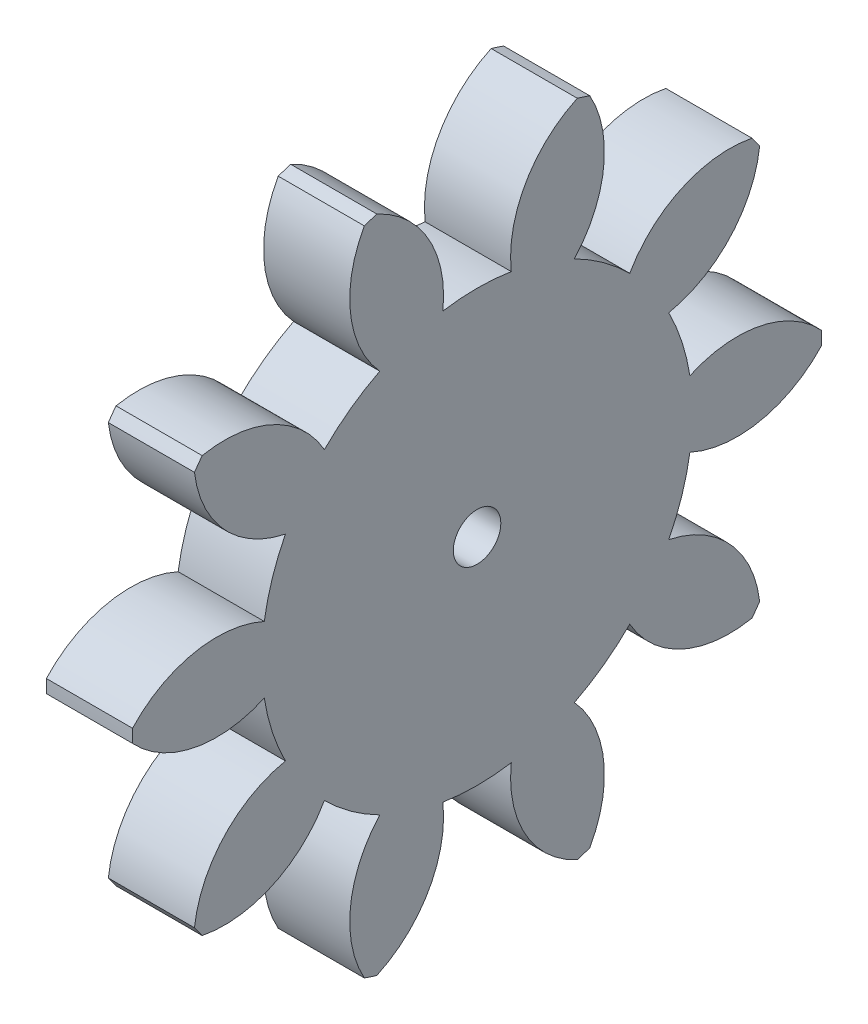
ISO-10303-21;
HEADER;
FILE_DESCRIPTION(('STEP AP214'),'2;1');
FILE_NAME('part.step','',(''),(''),'','','');
FILE_SCHEMA(('AUTOMOTIVE_DESIGN { 1 0 10303 214 1 1 1 1 }'));
ENDSEC;
DATA;
#1=APPLICATION_CONTEXT('core data for automotive mechanical design processes');
#2=APPLICATION_PROTOCOL_DEFINITION('international standard','automotive_design',2000,#1);
#3=PRODUCT_CONTEXT('',#1,'mechanical');
#4=PRODUCT('Part','Part','',(#3));
#5=PRODUCT_RELATED_PRODUCT_CATEGORY('part','',(#4));
#6=PRODUCT_DEFINITION_FORMATION('','',#4);
#7=PRODUCT_DEFINITION_CONTEXT('part definition',#1,'design');
#8=PRODUCT_DEFINITION('design','',#6,#7);
#9=PRODUCT_DEFINITION_SHAPE('','',#8);
#10=(LENGTH_UNIT() NAMED_UNIT(*) SI_UNIT(.MILLI.,.METRE.));
#11=(NAMED_UNIT(*) PLANE_ANGLE_UNIT() SI_UNIT($,.RADIAN.));
#12=(NAMED_UNIT(*) SI_UNIT($,.STERADIAN.) SOLID_ANGLE_UNIT());
#13=UNCERTAINTY_MEASURE_WITH_UNIT(LENGTH_MEASURE(1.E-05),#10,'distance_accuracy_value','');
#14=(GEOMETRIC_REPRESENTATION_CONTEXT(3) GLOBAL_UNCERTAINTY_ASSIGNED_CONTEXT((#13)) GLOBAL_UNIT_ASSIGNED_CONTEXT((#10,
#11,#12)) REPRESENTATION_CONTEXT('',''));
#15=CARTESIAN_POINT('',(0.,0.,0.));
#16=DIRECTION('',(0.,0.,1.));
#17=DIRECTION('',(1.,0.,0.));
#18=AXIS2_PLACEMENT_3D('',#15,#16,#17);
#19=CARTESIAN_POINT('',(6.35,0.,0.));
#20=DIRECTION('',(-1.,0.,0.));
#21=DIRECTION('',(0.,0.,1.));
#22=AXIS2_PLACEMENT_3D('',#19,#20,#21);
#23=PLANE('',#22);
#24=CARTESIAN_POINT('',(6.35,7.01361605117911,-18.612567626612));
#25=DIRECTION('',(-1.,0.,0.));
#26=DIRECTION('',(0.,-0.587785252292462,-0.809016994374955));
#27=AXIS2_PLACEMENT_3D('',#24,#25,#26);
#28=CIRCLE('',#27,8.46666666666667);
#29=CARTESIAN_POINT('',(6.35,11.1971090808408,-11.2516688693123));
#30=VERTEX_POINT('',#29);
#31=CARTESIAN_POINT('',(6.35,15.3182442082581,-20.2610807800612));
#32=VERTEX_POINT('',#31);
#33=EDGE_CURVE('E301',#30,#32,#28,.T.);
#34=ORIENTED_EDGE('',*,*,#33,.F.);
#35=CARTESIAN_POINT('',(6.35,0.,0.));
#36=DIRECTION('',(-1.,0.,0.));
#37=DIRECTION('',(0.,-0.587785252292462,-0.809016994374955));
#38=AXIS2_PLACEMENT_3D('',#35,#36,#37);
#39=CIRCLE('',#38,15.87373);
#40=CARTESIAN_POINT('',(6.35,14.1610699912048,-7.17212665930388));
#41=VERTEX_POINT('',#40);
#42=EDGE_CURVE('E300',#41,#30,#39,.T.);
#43=ORIENTED_EDGE('',*,*,#42,.F.);
#44=CARTESIAN_POINT('',(6.35,19.8689302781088,-0.918745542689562));
#45=DIRECTION('',(-1.,0.,0.));
#46=DIRECTION('',(0.,-0.587785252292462,-0.809016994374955));
#47=AXIS2_PLACEMENT_3D('',#44,#45,#46);
#48=CIRCLE('',#47,8.46666666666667);
#49=CARTESIAN_POINT('',(6.35,24.0030306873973,-8.3074976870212));
#50=VERTEX_POINT('',#49);
#51=EDGE_CURVE('E289',#50,#41,#48,.T.);
#52=ORIENTED_EDGE('',*,*,#51,.F.);
#53=CARTESIAN_POINT('',(6.35,0.,0.));
#54=DIRECTION('',(-1.,0.,0.));
#55=DIRECTION('',(0.,0.,1.));
#56=AXIS2_PLACEMENT_3D('',#53,#54,#55);
#57=CIRCLE('',#56,25.4);
#58=CARTESIAN_POINT('',(6.35,24.3018843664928,-7.38772063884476));
#59=VERTEX_POINT('',#58);
#60=EDGE_CURVE('E524',#59,#50,#57,.T.);
#61=ORIENTED_EDGE('',*,*,#60,.F.);
#62=CARTESIAN_POINT('',(6.35,16.6143273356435,-10.9353834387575));
#63=DIRECTION('',(-1.,0.,0.));
#64=DIRECTION('',(0.,0.,-1.));
#65=AXIS2_PLACEMENT_3D('',#62,#63,#64);
#66=CIRCLE('',#65,8.46666666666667);
#67=CARTESIAN_POINT('',(6.35,15.6722165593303,-2.52129574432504));
#68=VERTEX_POINT('',#67);
#69=EDGE_CURVE('E497',#68,#59,#66,.T.);
#70=ORIENTED_EDGE('',*,*,#69,.F.);
#71=CARTESIAN_POINT('',(6.35,0.,0.));
#72=DIRECTION('',(-1.,0.,0.));
#73=DIRECTION('',(0.,0.,-1.));
#74=AXIS2_PLACEMENT_3D('',#71,#72,#73);
#75=CIRCLE('',#74,15.87373);
#76=CARTESIAN_POINT('',(6.35,15.6722165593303,2.52129574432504));
#77=VERTEX_POINT('',#76);
#78=EDGE_CURVE('E502',#77,#68,#75,.T.);
#79=ORIENTED_EDGE('',*,*,#78,.F.);
#80=CARTESIAN_POINT('',(6.35,16.6143273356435,10.9353834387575));
#81=DIRECTION('',(-1.,0.,0.));
#82=DIRECTION('',(0.,0.,-1.));
#83=AXIS2_PLACEMENT_3D('',#80,#81,#82);
#84=CIRCLE('',#83,8.46666666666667);
#85=CARTESIAN_POINT('',(6.35,24.3018843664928,7.38772063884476));
#86=VERTEX_POINT('',#85);
#87=EDGE_CURVE('E499',#86,#77,#84,.T.);
#88=ORIENTED_EDGE('',*,*,#87,.F.);
#89=CARTESIAN_POINT('',(6.35,24.0030306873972,8.30749768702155));
#90=VERTEX_POINT('',#89);
#91=EDGE_CURVE('E522',#90,#86,#57,.T.);
#92=ORIENTED_EDGE('',*,*,#91,.F.);
#93=CARTESIAN_POINT('',(6.35,19.8689302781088,0.91874554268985));
#94=DIRECTION('',(-1.,0.,0.));
#95=DIRECTION('',(0.,0.587785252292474,-0.809016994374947));
#96=AXIS2_PLACEMENT_3D('',#93,#94,#95);
#97=CIRCLE('',#96,8.46666666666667);
#98=CARTESIAN_POINT('',(6.35,14.1610699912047,7.17212665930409));
#99=VERTEX_POINT('',#98);
#100=EDGE_CURVE('E475',#99,#90,#97,.T.);
#101=ORIENTED_EDGE('',*,*,#100,.F.);
#102=CARTESIAN_POINT('',(6.35,0.,0.));
#103=DIRECTION('',(-1.,0.,0.));
#104=DIRECTION('',(0.,0.587785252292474,-0.809016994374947));
#105=AXIS2_PLACEMENT_3D('',#102,#103,#104);
#106=CIRCLE('',#105,15.87373);
#107=CARTESIAN_POINT('',(6.35,11.1971090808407,11.2516688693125));
#108=VERTEX_POINT('',#107);
#109=EDGE_CURVE('E480',#108,#99,#106,.T.);
#110=ORIENTED_EDGE('',*,*,#109,.F.);
#111=CARTESIAN_POINT('',(6.35,7.01361605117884,18.6125676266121));
#112=DIRECTION('',(-1.,0.,0.));
#113=DIRECTION('',(0.,0.587785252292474,-0.809016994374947));
#114=AXIS2_PLACEMENT_3D('',#111,#112,#113);
#115=CIRCLE('',#114,8.46666666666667);
#116=CARTESIAN_POINT('',(6.35,15.3182442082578,20.2610807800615));
#117=VERTEX_POINT('',#116);
#118=EDGE_CURVE('E477',#117,#108,#115,.T.);
#119=ORIENTED_EDGE('',*,*,#118,.F.);
#120=CARTESIAN_POINT('',(6.35,14.5358351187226,20.8295342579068));
#121=VERTEX_POINT('',#120);
#122=EDGE_CURVE('E589',#121,#117,#57,.T.);
#123=ORIENTED_EDGE('',*,*,#122,.F.);
#124=CARTESIAN_POINT('',(6.35,15.5342771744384,12.4219449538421));
#125=DIRECTION('',(-1.,0.,0.));
#126=DIRECTION('',(0.,0.951056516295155,-0.309016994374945));
#127=AXIS2_PLACEMENT_3D('',#124,#125,#126);
#128=CIRCLE('',#127,8.46666666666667);
#129=CARTESIAN_POINT('',(6.35,7.24087600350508,14.1260404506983));
#130=VERTEX_POINT('',#129);
#131=EDGE_CURVE('E453',#130,#121,#128,.T.);
#132=ORIENTED_EDGE('',*,*,#131,.F.);
#133=CARTESIAN_POINT('',(6.35,0.,0.));
#134=DIRECTION('',(-1.,0.,0.));
#135=DIRECTION('',(0.,0.951056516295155,-0.309016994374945));
#136=AXIS2_PLACEMENT_3D('',#133,#134,#135);
#137=CIRCLE('',#136,15.87373);
#138=CARTESIAN_POINT('',(6.35,2.44508650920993,15.6842869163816));
#139=VERTEX_POINT('',#138);
#140=EDGE_CURVE('E458',#139,#130,#137,.T.);
#141=ORIENTED_EDGE('',*,*,#140,.F.);
#142=CARTESIAN_POINT('',(6.35,-5.26605818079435,19.1803835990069));
#143=DIRECTION('',(-1.,0.,0.));
#144=DIRECTION('',(0.,0.951056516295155,-0.309016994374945));
#145=AXIS2_PLACEMENT_3D('',#142,#143,#144);
#146=CIRCLE('',#145,8.46666666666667);
#147=CARTESIAN_POINT('',(6.35,0.48355541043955,25.3953967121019));
#148=VERTEX_POINT('',#147);
#149=EDGE_CURVE('E455',#148,#139,#146,.T.);
#150=ORIENTED_EDGE('',*,*,#149,.F.);
#151=CARTESIAN_POINT('',(6.35,-0.483555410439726,25.3953967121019));
#152=VERTEX_POINT('',#151);
#153=EDGE_CURVE('E584',#152,#148,#57,.T.);
#154=ORIENTED_EDGE('',*,*,#153,.F.);
#155=CARTESIAN_POINT('',(6.35,5.26605818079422,19.1803835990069));
#156=DIRECTION('',(-1.,0.,0.));
#157=DIRECTION('',(0.,0.951056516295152,0.309016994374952));
#158=AXIS2_PLACEMENT_3D('',#155,#156,#157);
#159=CIRCLE('',#158,8.46666666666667);
#160=CARTESIAN_POINT('',(6.35,-2.44508650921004,15.6842869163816));
#161=VERTEX_POINT('',#160);
#162=EDGE_CURVE('E431',#161,#152,#159,.T.);
#163=ORIENTED_EDGE('',*,*,#162,.F.);
#164=CARTESIAN_POINT('',(6.35,0.,0.));
#165=DIRECTION('',(-1.,0.,0.));
#166=DIRECTION('',(0.,0.951056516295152,0.309016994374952));
#167=AXIS2_PLACEMENT_3D('',#164,#165,#166);
#168=CIRCLE('',#167,15.87373);
#169=CARTESIAN_POINT('',(6.35,-7.24087600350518,14.1260404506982));
#170=VERTEX_POINT('',#169);
#171=EDGE_CURVE('E436',#170,#161,#168,.T.);
#172=ORIENTED_EDGE('',*,*,#171,.F.);
#173=CARTESIAN_POINT('',(6.35,-15.5342771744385,12.421944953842));
#174=DIRECTION('',(-1.,0.,0.));
#175=DIRECTION('',(0.,0.951056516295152,0.309016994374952));
#176=AXIS2_PLACEMENT_3D('',#173,#174,#175);
#177=CIRCLE('',#176,8.46666666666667);
#178=CARTESIAN_POINT('',(6.35,-14.5358351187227,20.8295342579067));
#179=VERTEX_POINT('',#178);
#180=EDGE_CURVE('E433',#179,#170,#177,.T.);
#181=ORIENTED_EDGE('',*,*,#180,.F.);
#182=CARTESIAN_POINT('',(6.35,-15.318244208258,20.2610807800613));
#183=VERTEX_POINT('',#182);
#184=EDGE_CURVE('E579',#183,#179,#57,.T.);
#185=ORIENTED_EDGE('',*,*,#184,.F.);
#186=CARTESIAN_POINT('',(6.35,-7.01361605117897,18.6125676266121));
#187=DIRECTION('',(-1.,0.,0.));
#188=DIRECTION('',(0.,0.587785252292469,0.809016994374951));
#189=AXIS2_PLACEMENT_3D('',#186,#187,#188);
#190=CIRCLE('',#189,8.46666666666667);
#191=CARTESIAN_POINT('',(6.35,-11.1971090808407,11.2516688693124));
#192=VERTEX_POINT('',#191);
#193=EDGE_CURVE('E409',#192,#183,#190,.T.);
#194=ORIENTED_EDGE('',*,*,#193,.F.);
#195=CARTESIAN_POINT('',(6.35,0.,0.));
#196=DIRECTION('',(-1.,0.,0.));
#197=DIRECTION('',(0.,0.587785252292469,0.809016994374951));
#198=AXIS2_PLACEMENT_3D('',#195,#196,#197);
#199=CIRCLE('',#198,15.87373);
#200=CARTESIAN_POINT('',(6.35,-14.1610699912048,7.17212665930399));
#201=VERTEX_POINT('',#200);
#202=EDGE_CURVE('E414',#201,#192,#199,.T.);
#203=ORIENTED_EDGE('',*,*,#202,.F.);
#204=CARTESIAN_POINT('',(6.35,-19.8689302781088,0.918745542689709));
#205=DIRECTION('',(-1.,0.,0.));
#206=DIRECTION('',(0.,0.587785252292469,0.809016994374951));
#207=AXIS2_PLACEMENT_3D('',#204,#205,#206);
#208=CIRCLE('',#207,8.46666666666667);
#209=CARTESIAN_POINT('',(6.35,-24.0030306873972,8.30749768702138));
#210=VERTEX_POINT('',#209);
#211=EDGE_CURVE('E411',#210,#201,#208,.T.);
#212=ORIENTED_EDGE('',*,*,#211,.F.);
#213=CARTESIAN_POINT('',(6.35,-24.3018843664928,7.38772063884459));
#214=VERTEX_POINT('',#213);
#215=EDGE_CURVE('E574',#214,#210,#57,.T.);
#216=ORIENTED_EDGE('',*,*,#215,.F.);
#217=CARTESIAN_POINT('',(6.35,-16.6143273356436,10.9353834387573));
#218=DIRECTION('',(-1.,0.,0.));
#219=DIRECTION('',(0.,0.,1.));
#220=AXIS2_PLACEMENT_3D('',#217,#218,#219);
#221=CIRCLE('',#220,8.46666666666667);
#222=CARTESIAN_POINT('',(6.35,-15.6722165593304,2.52129574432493));
#223=VERTEX_POINT('',#222);
#224=EDGE_CURVE('E387',#223,#214,#221,.T.);
#225=ORIENTED_EDGE('',*,*,#224,.F.);
#226=CARTESIAN_POINT('',(6.35,0.,0.));
#227=DIRECTION('',(-1.,0.,0.));
#228=DIRECTION('',(0.,0.,1.));
#229=AXIS2_PLACEMENT_3D('',#226,#227,#228);
#230=CIRCLE('',#229,15.87373);
#231=CARTESIAN_POINT('',(6.35,-15.6722165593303,-2.52129574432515));
#232=VERTEX_POINT('',#231);
#233=EDGE_CURVE('E392',#232,#223,#230,.T.);
#234=ORIENTED_EDGE('',*,*,#233,.F.);
#235=CARTESIAN_POINT('',(6.35,-16.6143273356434,-10.9353834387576));
#236=DIRECTION('',(-1.,0.,0.));
#237=DIRECTION('',(0.,0.,1.));
#238=AXIS2_PLACEMENT_3D('',#235,#236,#237);
#239=CIRCLE('',#238,8.46666666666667);
#240=CARTESIAN_POINT('',(6.35,-24.3018843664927,-7.38772063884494));
#241=VERTEX_POINT('',#240);
#242=EDGE_CURVE('E389',#241,#232,#239,.T.);
#243=ORIENTED_EDGE('',*,*,#242,.F.);
#244=CARTESIAN_POINT('',(6.35,-24.0030306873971,-8.30749768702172));
#245=VERTEX_POINT('',#244);
#246=EDGE_CURVE('E569',#245,#241,#57,.T.);
#247=ORIENTED_EDGE('',*,*,#246,.F.);
#248=CARTESIAN_POINT('',(6.35,-19.8689302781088,-0.918745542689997));
#249=DIRECTION('',(-1.,0.,0.));
#250=DIRECTION('',(0.,-0.58778525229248,0.809016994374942));
#251=AXIS2_PLACEMENT_3D('',#248,#249,#250);
#252=CIRCLE('',#251,8.46666666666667);
#253=CARTESIAN_POINT('',(6.35,-14.1610699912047,-7.1721266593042));
#254=VERTEX_POINT('',#253);
#255=EDGE_CURVE('E365',#254,#245,#252,.T.);
#256=ORIENTED_EDGE('',*,*,#255,.F.);
#257=CARTESIAN_POINT('',(6.35,0.,0.));
#258=DIRECTION('',(-1.,0.,0.));
#259=DIRECTION('',(0.,-0.58778525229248,0.809016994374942));
#260=AXIS2_PLACEMENT_3D('',#257,#258,#259);
#261=CIRCLE('',#260,15.87373);
#262=CARTESIAN_POINT('',(6.35,-11.1971090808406,-11.2516688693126));
#263=VERTEX_POINT('',#262);
#264=EDGE_CURVE('E370',#263,#254,#261,.T.);
#265=ORIENTED_EDGE('',*,*,#264,.F.);
#266=CARTESIAN_POINT('',(6.35,-7.0136160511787,-18.6125676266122));
#267=DIRECTION('',(-1.,0.,0.));
#268=DIRECTION('',(0.,-0.58778525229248,0.809016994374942));
#269=AXIS2_PLACEMENT_3D('',#266,#267,#268);
#270=CIRCLE('',#269,8.46666666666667);
#271=CARTESIAN_POINT('',(6.35,-15.3182442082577,-20.2610807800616));
#272=VERTEX_POINT('',#271);
#273=EDGE_CURVE('E367',#272,#263,#270,.T.);
#274=ORIENTED_EDGE('',*,*,#273,.F.);
#275=CARTESIAN_POINT('',(6.35,-14.5358351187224,-20.8295342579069));
#276=VERTEX_POINT('',#275);
#277=EDGE_CURVE('E564',#276,#272,#57,.T.);
#278=ORIENTED_EDGE('',*,*,#277,.F.);
#279=CARTESIAN_POINT('',(6.35,-15.5342771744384,-12.4219449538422));
#280=DIRECTION('',(-1.,0.,0.));
#281=DIRECTION('',(0.,-0.951056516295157,0.309016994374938));
#282=AXIS2_PLACEMENT_3D('',#279,#280,#281);
#283=CIRCLE('',#282,8.46666666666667);
#284=CARTESIAN_POINT('',(6.35,-7.24087600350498,-14.1260404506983));
#285=VERTEX_POINT('',#284);
#286=EDGE_CURVE('E343',#285,#276,#283,.T.);
#287=ORIENTED_EDGE('',*,*,#286,.F.);
#288=CARTESIAN_POINT('',(6.35,0.,0.));
#289=DIRECTION('',(-1.,0.,0.));
#290=DIRECTION('',(0.,-0.951056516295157,0.309016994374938));
#291=AXIS2_PLACEMENT_3D('',#288,#289,#290);
#292=CIRCLE('',#291,15.87373);
#293=CARTESIAN_POINT('',(6.35,-2.44508650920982,-15.6842869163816));
#294=VERTEX_POINT('',#293);
#295=EDGE_CURVE('E348',#294,#285,#292,.T.);
#296=ORIENTED_EDGE('',*,*,#295,.F.);
#297=CARTESIAN_POINT('',(6.35,5.26605818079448,-19.1803835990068));
#298=DIRECTION('',(-1.,0.,0.));
#299=DIRECTION('',(0.,-0.951056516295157,0.309016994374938));
#300=AXIS2_PLACEMENT_3D('',#297,#298,#299);
#301=CIRCLE('',#300,8.46666666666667);
#302=CARTESIAN_POINT('',(6.35,-0.483555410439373,-25.3953967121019));
#303=VERTEX_POINT('',#302);
#304=EDGE_CURVE('E345',#303,#294,#301,.T.);
#305=ORIENTED_EDGE('',*,*,#304,.F.);
#306=CARTESIAN_POINT('',(6.35,0.483555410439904,-25.3953967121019));
#307=VERTEX_POINT('',#306);
#308=EDGE_CURVE('E563',#307,#303,#57,.T.);
#309=ORIENTED_EDGE('',*,*,#308,.F.);
#310=CARTESIAN_POINT('',(6.35,-5.26605818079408,-19.1803835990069));
#311=DIRECTION('',(-1.,0.,0.));
#312=DIRECTION('',(0.,-0.95105651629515,-0.309016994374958));
#313=AXIS2_PLACEMENT_3D('',#310,#311,#312);
#314=CIRCLE('',#313,8.46666666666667);
#315=CARTESIAN_POINT('',(6.35,2.44508650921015,-15.6842869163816));
#316=VERTEX_POINT('',#315);
#317=EDGE_CURVE('E323',#316,#307,#314,.T.);
#318=ORIENTED_EDGE('',*,*,#317,.F.);
#319=CARTESIAN_POINT('',(6.35,0.,0.));
#320=DIRECTION('',(-1.,0.,0.));
#321=DIRECTION('',(0.,-0.95105651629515,-0.309016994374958));
#322=AXIS2_PLACEMENT_3D('',#319,#320,#321);
#323=CIRCLE('',#322,15.87373);
#324=CARTESIAN_POINT('',(6.35,7.24087600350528,-14.1260404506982));
#325=VERTEX_POINT('',#324);
#326=EDGE_CURVE('E328',#325,#316,#323,.T.);
#327=ORIENTED_EDGE('',*,*,#326,.F.);
#328=CARTESIAN_POINT('',(6.35,15.5342771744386,-12.4219449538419));
#329=DIRECTION('',(-1.,0.,0.));
#330=DIRECTION('',(0.,-0.95105651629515,-0.309016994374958));
#331=AXIS2_PLACEMENT_3D('',#328,#329,#330);
#332=CIRCLE('',#331,8.46666666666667);
#333=CARTESIAN_POINT('',(6.35,14.5358351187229,-20.8295342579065));
#334=VERTEX_POINT('',#333);
#335=EDGE_CURVE('E325',#334,#325,#332,.T.);
#336=ORIENTED_EDGE('',*,*,#335,.F.);
#337=EDGE_CURVE('E527',#32,#334,#57,.T.);
#338=ORIENTED_EDGE('',*,*,#337,.F.);
#339=EDGE_LOOP('',(#34,#43,#52,#61,#70,#79,#88,#92,#101,#110,#119,#123,#132,#141,#150,#154,#163,
#172,#181,#185,#194,#203,#212,#216,#225,#234,#243,#247,#256,#265,#274,#278,#287,#296,#305,#309,
#318,#327,#336,#338));
#340=FACE_BOUND('',#339,.T.);
#341=CARTESIAN_POINT('',(6.35,0.,0.));
#342=DIRECTION('',(1.,0.,0.));
#343=DIRECTION('',(0.,0.,-1.));
#344=AXIS2_PLACEMENT_3D('',#341,#342,#343);
#345=CIRCLE('',#344,1.75);
#346=CARTESIAN_POINT('',(6.35,0.,-1.75));
#347=VERTEX_POINT('',#346);
#348=EDGE_CURVE('E755',#347,#347,#345,.T.);
#349=ORIENTED_EDGE('',*,*,#348,.F.);
#350=EDGE_LOOP('',(#349));
#351=FACE_BOUND('',#350,.T.);
#352=ADVANCED_FACE('F33',(#340,#351),#23,.F.);
#353=CARTESIAN_POINT('',(0.,0.,0.));
#354=DIRECTION('',(1.,0.,0.));
#355=DIRECTION('',(0.,0.,-1.));
#356=AXIS2_PLACEMENT_3D('',#353,#354,#355);
#357=PLANE('',#356);
#358=CARTESIAN_POINT('',(0.,7.01361605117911,-18.612567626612));
#359=DIRECTION('',(-1.,0.,0.));
#360=DIRECTION('',(0.,-0.587785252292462,-0.809016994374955));
#361=AXIS2_PLACEMENT_3D('',#358,#359,#360);
#362=CIRCLE('',#361,8.46666666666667);
#363=CARTESIAN_POINT('',(0.,11.1971090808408,-11.2516688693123));
#364=VERTEX_POINT('',#363);
#365=CARTESIAN_POINT('',(0.,15.3182442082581,-20.2610807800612));
#366=VERTEX_POINT('',#365);
#367=EDGE_CURVE('E47',#364,#366,#362,.T.);
#368=ORIENTED_EDGE('',*,*,#367,.T.);
#369=CARTESIAN_POINT('',(0.,0.,0.));
#370=DIRECTION('',(-1.,0.,0.));
#371=DIRECTION('',(0.,0.,1.));
#372=AXIS2_PLACEMENT_3D('',#369,#370,#371);
#373=CIRCLE('',#372,25.4);
#374=CARTESIAN_POINT('',(0.,14.5358351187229,-20.8295342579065));
#375=VERTEX_POINT('',#374);
#376=EDGE_CURVE('E523',#366,#375,#373,.T.);
#377=ORIENTED_EDGE('',*,*,#376,.T.);
#378=CARTESIAN_POINT('',(0.,15.5342771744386,-12.4219449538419));
#379=DIRECTION('',(1.,0.,0.));
#380=DIRECTION('',(0.,0.,-1.));
#381=AXIS2_PLACEMENT_3D('',#378,#379,#380);
#382=CIRCLE('',#381,8.46666666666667);
#383=CARTESIAN_POINT('',(0.,7.24087600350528,-14.1260404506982));
#384=VERTEX_POINT('',#383);
#385=EDGE_CURVE('E40',#384,#375,#382,.T.);
#386=ORIENTED_EDGE('',*,*,#385,.F.);
#387=CARTESIAN_POINT('',(0.,0.,0.));
#388=DIRECTION('',(-1.,0.,0.));
#389=DIRECTION('',(0.,-0.95105651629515,-0.309016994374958));
#390=AXIS2_PLACEMENT_3D('',#387,#388,#389);
#391=CIRCLE('',#390,15.87373);
#392=CARTESIAN_POINT('',(0.,2.44508650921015,-15.6842869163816));
#393=VERTEX_POINT('',#392);
#394=EDGE_CURVE('E326',#384,#393,#391,.T.);
#395=ORIENTED_EDGE('',*,*,#394,.T.);
#396=CARTESIAN_POINT('',(0.,-5.26605818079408,-19.1803835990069));
#397=DIRECTION('',(-1.,0.,0.));
#398=DIRECTION('',(0.,-0.95105651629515,-0.309016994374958));
#399=AXIS2_PLACEMENT_3D('',#396,#397,#398);
#400=CIRCLE('',#399,8.46666666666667);
#401=CARTESIAN_POINT('',(0.,0.483555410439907,-25.3953967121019));
#402=VERTEX_POINT('',#401);
#403=EDGE_CURVE('E55',#393,#402,#400,.T.);
#404=ORIENTED_EDGE('',*,*,#403,.T.);
#405=CARTESIAN_POINT('',(0.,-0.483555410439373,-25.3953967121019));
#406=VERTEX_POINT('',#405);
#407=EDGE_CURVE('E758',#402,#406,#373,.T.);
#408=ORIENTED_EDGE('',*,*,#407,.T.);
#409=CARTESIAN_POINT('',(0.,5.26605818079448,-19.1803835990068));
#410=DIRECTION('',(1.,0.,0.));
#411=DIRECTION('',(0.,0.,-1.));
#412=AXIS2_PLACEMENT_3D('',#409,#410,#411);
#413=CIRCLE('',#412,8.46666666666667);
#414=CARTESIAN_POINT('',(0.,-2.44508650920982,-15.6842869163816));
#415=VERTEX_POINT('',#414);
#416=EDGE_CURVE('E548',#415,#406,#413,.T.);
#417=ORIENTED_EDGE('',*,*,#416,.F.);
#418=CARTESIAN_POINT('',(0.,0.,0.));
#419=DIRECTION('',(-1.,0.,0.));
#420=DIRECTION('',(0.,-0.951056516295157,0.309016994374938));
#421=AXIS2_PLACEMENT_3D('',#418,#419,#420);
#422=CIRCLE('',#421,15.87373);
#423=CARTESIAN_POINT('',(0.,-7.24087600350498,-14.1260404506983));
#424=VERTEX_POINT('',#423);
#425=EDGE_CURVE('E346',#415,#424,#422,.T.);
#426=ORIENTED_EDGE('',*,*,#425,.T.);
#427=CARTESIAN_POINT('',(0.,-15.5342771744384,-12.4219449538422));
#428=DIRECTION('',(-1.,0.,0.));
#429=DIRECTION('',(0.,-0.951056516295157,0.309016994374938));
#430=AXIS2_PLACEMENT_3D('',#427,#428,#429);
#431=CIRCLE('',#430,8.46666666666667);
#432=CARTESIAN_POINT('',(0.,-14.5358351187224,-20.8295342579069));
#433=VERTEX_POINT('',#432);
#434=EDGE_CURVE('E342',#424,#433,#431,.T.);
#435=ORIENTED_EDGE('',*,*,#434,.T.);
#436=CARTESIAN_POINT('',(0.,-15.3182442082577,-20.2610807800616));
#437=VERTEX_POINT('',#436);
#438=EDGE_CURVE('E759',#433,#437,#373,.T.);
#439=ORIENTED_EDGE('',*,*,#438,.T.);
#440=CARTESIAN_POINT('',(0.,-7.0136160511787,-18.6125676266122));
#441=DIRECTION('',(1.,0.,0.));
#442=DIRECTION('',(0.,0.,-1.));
#443=AXIS2_PLACEMENT_3D('',#440,#441,#442);
#444=CIRCLE('',#443,8.46666666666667);
#445=CARTESIAN_POINT('',(0.,-11.1971090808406,-11.2516688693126));
#446=VERTEX_POINT('',#445);
#447=EDGE_CURVE('E545',#446,#437,#444,.T.);
#448=ORIENTED_EDGE('',*,*,#447,.F.);
#449=CARTESIAN_POINT('',(0.,0.,0.));
#450=DIRECTION('',(-1.,0.,0.));
#451=DIRECTION('',(0.,-0.58778525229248,0.809016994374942));
#452=AXIS2_PLACEMENT_3D('',#449,#450,#451);
#453=CIRCLE('',#452,15.87373);
#454=CARTESIAN_POINT('',(0.,-14.1610699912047,-7.1721266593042));
#455=VERTEX_POINT('',#454);
#456=EDGE_CURVE('E368',#446,#455,#453,.T.);
#457=ORIENTED_EDGE('',*,*,#456,.T.);
#458=CARTESIAN_POINT('',(0.,-19.8689302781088,-0.918745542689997));
#459=DIRECTION('',(-1.,0.,0.));
#460=DIRECTION('',(0.,-0.58778525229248,0.809016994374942));
#461=AXIS2_PLACEMENT_3D('',#458,#459,#460);
#462=CIRCLE('',#461,8.46666666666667);
#463=CARTESIAN_POINT('',(0.,-24.0030306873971,-8.30749768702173));
#464=VERTEX_POINT('',#463);
#465=EDGE_CURVE('E364',#455,#464,#462,.T.);
#466=ORIENTED_EDGE('',*,*,#465,.T.);
#467=CARTESIAN_POINT('',(0.,-24.3018843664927,-7.38772063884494));
#468=VERTEX_POINT('',#467);
#469=EDGE_CURVE('E762',#464,#468,#373,.T.);
#470=ORIENTED_EDGE('',*,*,#469,.T.);
#471=CARTESIAN_POINT('',(0.,-16.6143273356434,-10.9353834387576));
#472=DIRECTION('',(1.,0.,0.));
#473=DIRECTION('',(0.,0.,-1.));
#474=AXIS2_PLACEMENT_3D('',#471,#472,#473);
#475=CIRCLE('',#474,8.46666666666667);
#476=CARTESIAN_POINT('',(0.,-15.6722165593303,-2.52129574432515));
#477=VERTEX_POINT('',#476);
#478=EDGE_CURVE('E542',#477,#468,#475,.T.);
#479=ORIENTED_EDGE('',*,*,#478,.F.);
#480=CARTESIAN_POINT('',(0.,0.,0.));
#481=DIRECTION('',(-1.,0.,0.));
#482=DIRECTION('',(0.,0.,1.));
#483=AXIS2_PLACEMENT_3D('',#480,#481,#482);
#484=CIRCLE('',#483,15.87373);
#485=CARTESIAN_POINT('',(0.,-15.6722165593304,2.52129574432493));
#486=VERTEX_POINT('',#485);
#487=EDGE_CURVE('E390',#477,#486,#484,.T.);
#488=ORIENTED_EDGE('',*,*,#487,.T.);
#489=CARTESIAN_POINT('',(0.,-16.6143273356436,10.9353834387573));
#490=DIRECTION('',(-1.,0.,0.));
#491=DIRECTION('',(0.,0.,1.));
#492=AXIS2_PLACEMENT_3D('',#489,#490,#491);
#493=CIRCLE('',#492,8.46666666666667);
#494=CARTESIAN_POINT('',(0.,-24.3018843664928,7.38772063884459));
#495=VERTEX_POINT('',#494);
#496=EDGE_CURVE('E386',#486,#495,#493,.T.);
#497=ORIENTED_EDGE('',*,*,#496,.T.);
#498=CARTESIAN_POINT('',(0.,-24.0030306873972,8.30749768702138));
#499=VERTEX_POINT('',#498);
#500=EDGE_CURVE('E765',#495,#499,#373,.T.);
#501=ORIENTED_EDGE('',*,*,#500,.T.);
#502=CARTESIAN_POINT('',(0.,-19.8689302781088,0.918745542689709));
#503=DIRECTION('',(1.,0.,0.));
#504=DIRECTION('',(0.,0.,-1.));
#505=AXIS2_PLACEMENT_3D('',#502,#503,#504);
#506=CIRCLE('',#505,8.46666666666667);
#507=CARTESIAN_POINT('',(0.,-14.1610699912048,7.17212665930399));
#508=VERTEX_POINT('',#507);
#509=EDGE_CURVE('E539',#508,#499,#506,.T.);
#510=ORIENTED_EDGE('',*,*,#509,.F.);
#511=CARTESIAN_POINT('',(0.,0.,0.));
#512=DIRECTION('',(-1.,0.,0.));
#513=DIRECTION('',(0.,0.587785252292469,0.809016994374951));
#514=AXIS2_PLACEMENT_3D('',#511,#512,#513);
#515=CIRCLE('',#514,15.87373);
#516=CARTESIAN_POINT('',(0.,-11.1971090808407,11.2516688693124));
#517=VERTEX_POINT('',#516);
#518=EDGE_CURVE('E412',#508,#517,#515,.T.);
#519=ORIENTED_EDGE('',*,*,#518,.T.);
#520=CARTESIAN_POINT('',(0.,-7.01361605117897,18.6125676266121));
#521=DIRECTION('',(-1.,0.,0.));
#522=DIRECTION('',(0.,0.587785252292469,0.809016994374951));
#523=AXIS2_PLACEMENT_3D('',#520,#521,#522);
#524=CIRCLE('',#523,8.46666666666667);
#525=CARTESIAN_POINT('',(0.,-15.318244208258,20.2610807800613));
#526=VERTEX_POINT('',#525);
#527=EDGE_CURVE('E408',#517,#526,#524,.T.);
#528=ORIENTED_EDGE('',*,*,#527,.T.);
#529=CARTESIAN_POINT('',(0.,-14.5358351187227,20.8295342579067));
#530=VERTEX_POINT('',#529);
#531=EDGE_CURVE('E768',#526,#530,#373,.T.);
#532=ORIENTED_EDGE('',*,*,#531,.T.);
#533=CARTESIAN_POINT('',(0.,-15.5342771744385,12.421944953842));
#534=DIRECTION('',(1.,0.,0.));
#535=DIRECTION('',(0.,0.,-1.));
#536=AXIS2_PLACEMENT_3D('',#533,#534,#535);
#537=CIRCLE('',#536,8.46666666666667);
#538=CARTESIAN_POINT('',(0.,-7.24087600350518,14.1260404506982));
#539=VERTEX_POINT('',#538);
#540=EDGE_CURVE('E536',#539,#530,#537,.T.);
#541=ORIENTED_EDGE('',*,*,#540,.F.);
#542=CARTESIAN_POINT('',(0.,0.,0.));
#543=DIRECTION('',(-1.,0.,0.));
#544=DIRECTION('',(0.,0.951056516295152,0.309016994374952));
#545=AXIS2_PLACEMENT_3D('',#542,#543,#544);
#546=CIRCLE('',#545,15.87373);
#547=CARTESIAN_POINT('',(0.,-2.44508650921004,15.6842869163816));
#548=VERTEX_POINT('',#547);
#549=EDGE_CURVE('E434',#539,#548,#546,.T.);
#550=ORIENTED_EDGE('',*,*,#549,.T.);
#551=CARTESIAN_POINT('',(0.,5.26605818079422,19.1803835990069));
#552=DIRECTION('',(-1.,0.,0.));
#553=DIRECTION('',(0.,0.951056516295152,0.309016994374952));
#554=AXIS2_PLACEMENT_3D('',#551,#552,#553);
#555=CIRCLE('',#554,8.46666666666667);
#556=CARTESIAN_POINT('',(0.,-0.483555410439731,25.3953967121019));
#557=VERTEX_POINT('',#556);
#558=EDGE_CURVE('E430',#548,#557,#555,.T.);
#559=ORIENTED_EDGE('',*,*,#558,.T.);
#560=CARTESIAN_POINT('',(0.,0.483555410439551,25.3953967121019));
#561=VERTEX_POINT('',#560);
#562=EDGE_CURVE('E771',#557,#561,#373,.T.);
#563=ORIENTED_EDGE('',*,*,#562,.T.);
#564=CARTESIAN_POINT('',(0.,-5.26605818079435,19.1803835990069));
#565=DIRECTION('',(1.,0.,0.));
#566=DIRECTION('',(0.,0.,-1.));
#567=AXIS2_PLACEMENT_3D('',#564,#565,#566);
#568=CIRCLE('',#567,8.46666666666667);
#569=CARTESIAN_POINT('',(0.,2.44508650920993,15.6842869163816));
#570=VERTEX_POINT('',#569);
#571=EDGE_CURVE('E533',#570,#561,#568,.T.);
#572=ORIENTED_EDGE('',*,*,#571,.F.);
#573=CARTESIAN_POINT('',(0.,0.,0.));
#574=DIRECTION('',(-1.,0.,0.));
#575=DIRECTION('',(0.,0.951056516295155,-0.309016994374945));
#576=AXIS2_PLACEMENT_3D('',#573,#574,#575);
#577=CIRCLE('',#576,15.87373);
#578=CARTESIAN_POINT('',(0.,7.24087600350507,14.1260404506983));
#579=VERTEX_POINT('',#578);
#580=EDGE_CURVE('E456',#570,#579,#577,.T.);
#581=ORIENTED_EDGE('',*,*,#580,.T.);
#582=CARTESIAN_POINT('',(0.,15.5342771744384,12.4219449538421));
#583=DIRECTION('',(-1.,0.,0.));
#584=DIRECTION('',(0.,0.951056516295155,-0.309016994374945));
#585=AXIS2_PLACEMENT_3D('',#582,#583,#584);
#586=CIRCLE('',#585,8.46666666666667);
#587=CARTESIAN_POINT('',(0.,14.5358351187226,20.8295342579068));
#588=VERTEX_POINT('',#587);
#589=EDGE_CURVE('E452',#579,#588,#586,.T.);
#590=ORIENTED_EDGE('',*,*,#589,.T.);
#591=CARTESIAN_POINT('',(0.,15.3182442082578,20.2610807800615));
#592=VERTEX_POINT('',#591);
#593=EDGE_CURVE('E774',#588,#592,#373,.T.);
#594=ORIENTED_EDGE('',*,*,#593,.T.);
#595=CARTESIAN_POINT('',(0.,7.01361605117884,18.6125676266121));
#596=DIRECTION('',(1.,0.,0.));
#597=DIRECTION('',(0.,0.,-1.));
#598=AXIS2_PLACEMENT_3D('',#595,#596,#597);
#599=CIRCLE('',#598,8.46666666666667);
#600=CARTESIAN_POINT('',(0.,11.1971090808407,11.2516688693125));
#601=VERTEX_POINT('',#600);
#602=EDGE_CURVE('E530',#601,#592,#599,.T.);
#603=ORIENTED_EDGE('',*,*,#602,.F.);
#604=CARTESIAN_POINT('',(0.,0.,0.));
#605=DIRECTION('',(-1.,0.,0.));
#606=DIRECTION('',(0.,0.587785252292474,-0.809016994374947));
#607=AXIS2_PLACEMENT_3D('',#604,#605,#606);
#608=CIRCLE('',#607,15.87373);
#609=CARTESIAN_POINT('',(0.,14.1610699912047,7.17212665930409));
#610=VERTEX_POINT('',#609);
#611=EDGE_CURVE('E478',#601,#610,#608,.T.);
#612=ORIENTED_EDGE('',*,*,#611,.T.);
#613=CARTESIAN_POINT('',(0.,19.8689302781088,0.91874554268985));
#614=DIRECTION('',(-1.,0.,0.));
#615=DIRECTION('',(0.,0.587785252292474,-0.809016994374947));
#616=AXIS2_PLACEMENT_3D('',#613,#614,#615);
#617=CIRCLE('',#616,8.46666666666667);
#618=CARTESIAN_POINT('',(0.,24.0030306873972,8.30749768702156));
#619=VERTEX_POINT('',#618);
#620=EDGE_CURVE('E474',#610,#619,#617,.T.);
#621=ORIENTED_EDGE('',*,*,#620,.T.);
#622=CARTESIAN_POINT('',(0.,24.3018843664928,7.38772063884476));
#623=VERTEX_POINT('',#622);
#624=EDGE_CURVE('E518',#619,#623,#373,.T.);
#625=ORIENTED_EDGE('',*,*,#624,.T.);
#626=CARTESIAN_POINT('',(0.,16.6143273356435,10.9353834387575));
#627=DIRECTION('',(1.,0.,0.));
#628=DIRECTION('',(0.,0.,-1.));
#629=AXIS2_PLACEMENT_3D('',#626,#627,#628);
#630=CIRCLE('',#629,8.46666666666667);
#631=CARTESIAN_POINT('',(0.,15.6722165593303,2.52129574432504));
#632=VERTEX_POINT('',#631);
#633=EDGE_CURVE('E526',#632,#623,#630,.T.);
#634=ORIENTED_EDGE('',*,*,#633,.F.);
#635=CARTESIAN_POINT('',(0.,0.,0.));
#636=DIRECTION('',(-1.,0.,0.));
#637=DIRECTION('',(0.,0.,-1.));
#638=AXIS2_PLACEMENT_3D('',#635,#636,#637);
#639=CIRCLE('',#638,15.87373);
#640=CARTESIAN_POINT('',(0.,15.6722165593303,-2.52129574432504));
#641=VERTEX_POINT('',#640);
#642=EDGE_CURVE('E500',#632,#641,#639,.T.);
#643=ORIENTED_EDGE('',*,*,#642,.T.);
#644=CARTESIAN_POINT('',(0.,16.6143273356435,-10.9353834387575));
#645=DIRECTION('',(-1.,0.,0.));
#646=DIRECTION('',(0.,0.,-1.));
#647=AXIS2_PLACEMENT_3D('',#644,#645,#646);
#648=CIRCLE('',#647,8.46666666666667);
#649=CARTESIAN_POINT('',(0.,24.3018843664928,-7.38772063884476));
#650=VERTEX_POINT('',#649);
#651=EDGE_CURVE('E496',#641,#650,#648,.T.);
#652=ORIENTED_EDGE('',*,*,#651,.T.);
#653=CARTESIAN_POINT('',(0.,24.0030306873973,-8.3074976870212));
#654=VERTEX_POINT('',#653);
#655=EDGE_CURVE('E519',#650,#654,#373,.T.);
#656=ORIENTED_EDGE('',*,*,#655,.T.);
#657=CARTESIAN_POINT('',(0.,19.8689302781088,-0.918745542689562));
#658=DIRECTION('',(1.,0.,0.));
#659=DIRECTION('',(0.,0.,-1.));
#660=AXIS2_PLACEMENT_3D('',#657,#658,#659);
#661=CIRCLE('',#660,8.46666666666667);
#662=CARTESIAN_POINT('',(0.,14.1610699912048,-7.17212665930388));
#663=VERTEX_POINT('',#662);
#664=EDGE_CURVE('E11',#663,#654,#661,.T.);
#665=ORIENTED_EDGE('',*,*,#664,.F.);
#666=CARTESIAN_POINT('',(0.,0.,0.));
#667=DIRECTION('',(-1.,0.,0.));
#668=DIRECTION('',(0.,-0.587785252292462,-0.809016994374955));
#669=AXIS2_PLACEMENT_3D('',#666,#667,#668);
#670=CIRCLE('',#669,15.87373);
#671=EDGE_CURVE('E306',#663,#364,#670,.T.);
#672=ORIENTED_EDGE('',*,*,#671,.T.);
#673=EDGE_LOOP('',(#368,#377,#386,#395,#404,#408,#417,#426,#435,#439,#448,#457,#466,#470,#479,
#488,#497,#501,#510,#519,#528,#532,#541,#550,#559,#563,#572,#581,#590,#594,#603,#612,#621,#625,
#634,#643,#652,#656,#665,#672));
#674=FACE_BOUND('',#673,.T.);
#675=CARTESIAN_POINT('',(0.,0.,0.));
#676=DIRECTION('',(1.,0.,0.));
#677=DIRECTION('',(0.,0.,-1.));
#678=AXIS2_PLACEMENT_3D('',#675,#676,#677);
#679=CIRCLE('',#678,1.75);
#680=CARTESIAN_POINT('',(0.,0.,-1.75));
#681=VERTEX_POINT('',#680);
#682=EDGE_CURVE('E318',#681,#681,#679,.F.);
#683=ORIENTED_EDGE('',*,*,#682,.F.);
#684=EDGE_LOOP('',(#683));
#685=FACE_BOUND('',#684,.T.);
#686=ADVANCED_FACE('F620',(#674,#685),#357,.F.);
#687=CARTESIAN_POINT('',(-10.,0.,0.));
#688=DIRECTION('',(-1.,0.,0.));
#689=DIRECTION('',(0.,0.,1.));
#690=AXIS2_PLACEMENT_3D('',#687,#688,#689);
#691=CYLINDRICAL_SURFACE('',#690,25.4);
#692=DIRECTION('',(-1.,0.,0.));
#693=VECTOR('',#692,1.);
#694=CARTESIAN_POINT('',(3.175,15.3182442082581,-20.2610807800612));
#695=LINE('',#694,#693);
#696=EDGE_CURVE('E321',#32,#366,#695,.T.);
#697=ORIENTED_EDGE('',*,*,#696,.F.);
#698=ORIENTED_EDGE('',*,*,#337,.T.);
#699=DIRECTION('',(-1.,0.,0.));
#700=VECTOR('',#699,1.);
#701=CARTESIAN_POINT('',(3.175,14.5358351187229,-20.8295342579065));
#702=LINE('',#701,#700);
#703=EDGE_CURVE('E337',#375,#334,#702,.F.);
#704=ORIENTED_EDGE('',*,*,#703,.F.);
#705=ORIENTED_EDGE('',*,*,#376,.F.);
#706=EDGE_LOOP('',(#697,#698,#704,#705));
#707=FACE_BOUND('',#706,.T.);
#708=ADVANCED_FACE('F562',(#707),#691,.T.);
#709=DIRECTION('',(-1.,0.,0.));
#710=VECTOR('',#709,1.);
#711=CARTESIAN_POINT('',(3.175,24.0030306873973,-8.3074976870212));
#712=LINE('',#711,#710);
#713=EDGE_CURVE('E295',#654,#50,#712,.F.);
#714=ORIENTED_EDGE('',*,*,#713,.F.);
#715=ORIENTED_EDGE('',*,*,#655,.F.);
#716=DIRECTION('',(-1.,0.,0.));
#717=VECTOR('',#716,1.);
#718=CARTESIAN_POINT('',(3.175,24.3018843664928,-7.38772063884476));
#719=LINE('',#718,#717);
#720=EDGE_CURVE('E516',#59,#650,#719,.T.);
#721=ORIENTED_EDGE('',*,*,#720,.F.);
#722=ORIENTED_EDGE('',*,*,#60,.T.);
#723=EDGE_LOOP('',(#714,#715,#721,#722));
#724=FACE_BOUND('',#723,.T.);
#725=ADVANCED_FACE('F623',(#724),#691,.T.);
#726=DIRECTION('',(-1.,0.,0.));
#727=VECTOR('',#726,1.);
#728=CARTESIAN_POINT('',(3.175,0.483555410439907,-25.3953967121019));
#729=LINE('',#728,#727);
#730=EDGE_CURVE('E340',#307,#402,#729,.T.);
#731=ORIENTED_EDGE('',*,*,#730,.F.);
#732=ORIENTED_EDGE('',*,*,#308,.T.);
#733=DIRECTION('',(-1.,0.,0.));
#734=VECTOR('',#733,1.);
#735=CARTESIAN_POINT('',(3.175,-0.483555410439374,-25.3953967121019));
#736=LINE('',#735,#734);
#737=EDGE_CURVE('E359',#406,#303,#736,.F.);
#738=ORIENTED_EDGE('',*,*,#737,.F.);
#739=ORIENTED_EDGE('',*,*,#407,.F.);
#740=EDGE_LOOP('',(#731,#732,#738,#739));
#741=FACE_BOUND('',#740,.T.);
#742=ADVANCED_FACE('F625',(#741),#691,.T.);
#743=DIRECTION('',(-1.,0.,0.));
#744=VECTOR('',#743,1.);
#745=CARTESIAN_POINT('',(3.175,-14.5358351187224,-20.8295342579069));
#746=LINE('',#745,#744);
#747=EDGE_CURVE('E362',#276,#433,#746,.T.);
#748=ORIENTED_EDGE('',*,*,#747,.F.);
#749=ORIENTED_EDGE('',*,*,#277,.T.);
#750=DIRECTION('',(-1.,0.,0.));
#751=VECTOR('',#750,1.);
#752=CARTESIAN_POINT('',(3.175,-15.3182442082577,-20.2610807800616));
#753=LINE('',#752,#751);
#754=EDGE_CURVE('E381',#437,#272,#753,.F.);
#755=ORIENTED_EDGE('',*,*,#754,.F.);
#756=ORIENTED_EDGE('',*,*,#438,.F.);
#757=EDGE_LOOP('',(#748,#749,#755,#756));
#758=FACE_BOUND('',#757,.T.);
#759=ADVANCED_FACE('F630',(#758),#691,.T.);
#760=DIRECTION('',(-1.,0.,0.));
#761=VECTOR('',#760,1.);
#762=CARTESIAN_POINT('',(3.175,-24.0030306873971,-8.30749768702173));
#763=LINE('',#762,#761);
#764=EDGE_CURVE('E384',#245,#464,#763,.T.);
#765=ORIENTED_EDGE('',*,*,#764,.F.);
#766=ORIENTED_EDGE('',*,*,#246,.T.);
#767=DIRECTION('',(-1.,0.,0.));
#768=VECTOR('',#767,1.);
#769=CARTESIAN_POINT('',(3.175,-24.3018843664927,-7.38772063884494));
#770=LINE('',#769,#768);
#771=EDGE_CURVE('E403',#468,#241,#770,.F.);
#772=ORIENTED_EDGE('',*,*,#771,.F.);
#773=ORIENTED_EDGE('',*,*,#469,.F.);
#774=EDGE_LOOP('',(#765,#766,#772,#773));
#775=FACE_BOUND('',#774,.T.);
#776=ADVANCED_FACE('F813',(#775),#691,.T.);
#777=DIRECTION('',(-1.,0.,0.));
#778=VECTOR('',#777,1.);
#779=CARTESIAN_POINT('',(3.175,-24.3018843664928,7.38772063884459));
#780=LINE('',#779,#778);
#781=EDGE_CURVE('E406',#214,#495,#780,.T.);
#782=ORIENTED_EDGE('',*,*,#781,.F.);
#783=ORIENTED_EDGE('',*,*,#215,.T.);
#784=DIRECTION('',(-1.,0.,0.));
#785=VECTOR('',#784,1.);
#786=CARTESIAN_POINT('',(3.175,-24.0030306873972,8.30749768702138));
#787=LINE('',#786,#785);
#788=EDGE_CURVE('E425',#499,#210,#787,.F.);
#789=ORIENTED_EDGE('',*,*,#788,.F.);
#790=ORIENTED_EDGE('',*,*,#500,.F.);
#791=EDGE_LOOP('',(#782,#783,#789,#790));
#792=FACE_BOUND('',#791,.T.);
#793=ADVANCED_FACE('F806',(#792),#691,.T.);
#794=DIRECTION('',(-1.,0.,0.));
#795=VECTOR('',#794,1.);
#796=CARTESIAN_POINT('',(3.175,-15.318244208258,20.2610807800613));
#797=LINE('',#796,#795);
#798=EDGE_CURVE('E428',#183,#526,#797,.T.);
#799=ORIENTED_EDGE('',*,*,#798,.F.);
#800=ORIENTED_EDGE('',*,*,#184,.T.);
#801=DIRECTION('',(-1.,0.,0.));
#802=VECTOR('',#801,1.);
#803=CARTESIAN_POINT('',(3.175,-14.5358351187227,20.8295342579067));
#804=LINE('',#803,#802);
#805=EDGE_CURVE('E447',#530,#179,#804,.F.);
#806=ORIENTED_EDGE('',*,*,#805,.F.);
#807=ORIENTED_EDGE('',*,*,#531,.F.);
#808=EDGE_LOOP('',(#799,#800,#806,#807));
#809=FACE_BOUND('',#808,.T.);
#810=ADVANCED_FACE('F799',(#809),#691,.T.);
#811=DIRECTION('',(-1.,0.,0.));
#812=VECTOR('',#811,1.);
#813=CARTESIAN_POINT('',(3.175,-0.483555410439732,25.3953967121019));
#814=LINE('',#813,#812);
#815=EDGE_CURVE('E450',#152,#557,#814,.T.);
#816=ORIENTED_EDGE('',*,*,#815,.F.);
#817=ORIENTED_EDGE('',*,*,#153,.T.);
#818=DIRECTION('',(-1.,0.,0.));
#819=VECTOR('',#818,1.);
#820=CARTESIAN_POINT('',(3.175,0.483555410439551,25.3953967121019));
#821=LINE('',#820,#819);
#822=EDGE_CURVE('E469',#561,#148,#821,.F.);
#823=ORIENTED_EDGE('',*,*,#822,.F.);
#824=ORIENTED_EDGE('',*,*,#562,.F.);
#825=EDGE_LOOP('',(#816,#817,#823,#824));
#826=FACE_BOUND('',#825,.T.);
#827=ADVANCED_FACE('F792',(#826),#691,.T.);
#828=DIRECTION('',(-1.,0.,0.));
#829=VECTOR('',#828,1.);
#830=CARTESIAN_POINT('',(3.175,14.5358351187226,20.8295342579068));
#831=LINE('',#830,#829);
#832=EDGE_CURVE('E472',#121,#588,#831,.T.);
#833=ORIENTED_EDGE('',*,*,#832,.F.);
#834=ORIENTED_EDGE('',*,*,#122,.T.);
#835=DIRECTION('',(-1.,0.,0.));
#836=VECTOR('',#835,1.);
#837=CARTESIAN_POINT('',(3.175,15.3182442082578,20.2610807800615));
#838=LINE('',#837,#836);
#839=EDGE_CURVE('E491',#592,#117,#838,.F.);
#840=ORIENTED_EDGE('',*,*,#839,.F.);
#841=ORIENTED_EDGE('',*,*,#593,.F.);
#842=EDGE_LOOP('',(#833,#834,#840,#841));
#843=FACE_BOUND('',#842,.T.);
#844=ADVANCED_FACE('F785',(#843),#691,.T.);
#845=DIRECTION('',(-1.,0.,0.));
#846=VECTOR('',#845,1.);
#847=CARTESIAN_POINT('',(3.175,24.0030306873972,8.30749768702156));
#848=LINE('',#847,#846);
#849=EDGE_CURVE('E494',#90,#619,#848,.T.);
#850=ORIENTED_EDGE('',*,*,#849,.F.);
#851=ORIENTED_EDGE('',*,*,#91,.T.);
#852=DIRECTION('',(-1.,0.,0.));
#853=VECTOR('',#852,1.);
#854=CARTESIAN_POINT('',(3.175,24.3018843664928,7.38772063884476));
#855=LINE('',#854,#853);
#856=EDGE_CURVE('E513',#623,#86,#855,.F.);
#857=ORIENTED_EDGE('',*,*,#856,.F.);
#858=ORIENTED_EDGE('',*,*,#624,.F.);
#859=EDGE_LOOP('',(#850,#851,#857,#858));
#860=FACE_BOUND('',#859,.T.);
#861=ADVANCED_FACE('F602',(#860),#691,.T.);
#862=CARTESIAN_POINT('',(6.35,16.6143273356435,-10.9353834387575));
#863=DIRECTION('',(-1.,0.,0.));
#864=DIRECTION('',(0.,0.,1.));
#865=AXIS2_PLACEMENT_3D('',#862,#863,#864);
#866=CYLINDRICAL_SURFACE('',#865,8.46666666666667);
#867=ORIENTED_EDGE('',*,*,#720,.T.);
#868=ORIENTED_EDGE('',*,*,#651,.F.);
#869=DIRECTION('',(-1.,0.,0.));
#870=VECTOR('',#869,1.);
#871=CARTESIAN_POINT('',(6.35,15.6722165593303,-2.52129574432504));
#872=LINE('',#871,#870);
#873=EDGE_CURVE('E504',#68,#641,#872,.T.);
#874=ORIENTED_EDGE('',*,*,#873,.F.);
#875=ORIENTED_EDGE('',*,*,#69,.T.);
#876=EDGE_LOOP('',(#867,#868,#874,#875));
#877=FACE_BOUND('',#876,.T.);
#878=ADVANCED_FACE('F617',(#877),#866,.T.);
#879=CARTESIAN_POINT('',(6.35,16.6143273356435,10.9353834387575));
#880=DIRECTION('',(-1.,0.,0.));
#881=DIRECTION('',(0.,0.,1.));
#882=AXIS2_PLACEMENT_3D('',#879,#880,#881);
#883=CYLINDRICAL_SURFACE('',#882,8.46666666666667);
#884=ORIENTED_EDGE('',*,*,#856,.T.);
#885=ORIENTED_EDGE('',*,*,#87,.T.);
#886=DIRECTION('',(-1.,0.,0.));
#887=VECTOR('',#886,1.);
#888=CARTESIAN_POINT('',(6.35,15.6722165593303,2.52129574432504));
#889=LINE('',#888,#887);
#890=EDGE_CURVE('E511',#77,#632,#889,.T.);
#891=ORIENTED_EDGE('',*,*,#890,.T.);
#892=ORIENTED_EDGE('',*,*,#633,.T.);
#893=EDGE_LOOP('',(#884,#885,#891,#892));
#894=FACE_BOUND('',#893,.T.);
#895=ADVANCED_FACE('F607',(#894),#883,.T.);
#896=CARTESIAN_POINT('',(6.35,0.,0.));
#897=DIRECTION('',(-1.,0.,0.));
#898=DIRECTION('',(0.,0.,1.));
#899=AXIS2_PLACEMENT_3D('',#896,#897,#898);
#900=CYLINDRICAL_SURFACE('',#899,15.87373);
#901=ORIENTED_EDGE('',*,*,#642,.F.);
#902=ORIENTED_EDGE('',*,*,#890,.F.);
#903=ORIENTED_EDGE('',*,*,#78,.T.);
#904=ORIENTED_EDGE('',*,*,#873,.T.);
#905=EDGE_LOOP('',(#901,#902,#903,#904));
#906=FACE_BOUND('',#905,.T.);
#907=ADVANCED_FACE('F615',(#906),#900,.T.);
#908=CARTESIAN_POINT('',(6.35,19.8689302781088,0.91874554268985));
#909=DIRECTION('',(-1.,0.,0.));
#910=DIRECTION('',(0.,0.,1.));
#911=AXIS2_PLACEMENT_3D('',#908,#909,#910);
#912=CYLINDRICAL_SURFACE('',#911,8.46666666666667);
#913=ORIENTED_EDGE('',*,*,#849,.T.);
#914=ORIENTED_EDGE('',*,*,#620,.F.);
#915=DIRECTION('',(-1.,0.,0.));
#916=VECTOR('',#915,1.);
#917=CARTESIAN_POINT('',(6.35,14.1610699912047,7.17212665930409));
#918=LINE('',#917,#916);
#919=EDGE_CURVE('E482',#99,#610,#918,.T.);
#920=ORIENTED_EDGE('',*,*,#919,.F.);
#921=ORIENTED_EDGE('',*,*,#100,.T.);
#922=EDGE_LOOP('',(#913,#914,#920,#921));
#923=FACE_BOUND('',#922,.T.);
#924=ADVANCED_FACE('F645',(#923),#912,.T.);
#925=CARTESIAN_POINT('',(6.35,7.01361605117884,18.6125676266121));
#926=DIRECTION('',(-1.,0.,0.));
#927=DIRECTION('',(0.,0.,1.));
#928=AXIS2_PLACEMENT_3D('',#925,#926,#927);
#929=CYLINDRICAL_SURFACE('',#928,8.46666666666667);
#930=ORIENTED_EDGE('',*,*,#839,.T.);
#931=ORIENTED_EDGE('',*,*,#118,.T.);
#932=DIRECTION('',(-1.,0.,0.));
#933=VECTOR('',#932,1.);
#934=CARTESIAN_POINT('',(6.35,11.1971090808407,11.2516688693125));
#935=LINE('',#934,#933);
#936=EDGE_CURVE('E489',#108,#601,#935,.T.);
#937=ORIENTED_EDGE('',*,*,#936,.T.);
#938=ORIENTED_EDGE('',*,*,#602,.T.);
#939=EDGE_LOOP('',(#930,#931,#937,#938));
#940=FACE_BOUND('',#939,.T.);
#941=ADVANCED_FACE('F648',(#940),#929,.T.);
#942=CARTESIAN_POINT('',(6.35,0.,0.));
#943=DIRECTION('',(-1.,0.,0.));
#944=DIRECTION('',(0.,0.,1.));
#945=AXIS2_PLACEMENT_3D('',#942,#943,#944);
#946=CYLINDRICAL_SURFACE('',#945,15.87373);
#947=ORIENTED_EDGE('',*,*,#611,.F.);
#948=ORIENTED_EDGE('',*,*,#936,.F.);
#949=ORIENTED_EDGE('',*,*,#109,.T.);
#950=ORIENTED_EDGE('',*,*,#919,.T.);
#951=EDGE_LOOP('',(#947,#948,#949,#950));
#952=FACE_BOUND('',#951,.T.);
#953=ADVANCED_FACE('F652',(#952),#946,.T.);
#954=CARTESIAN_POINT('',(6.35,15.5342771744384,12.4219449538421));
#955=DIRECTION('',(-1.,0.,0.));
#956=DIRECTION('',(0.,0.,1.));
#957=AXIS2_PLACEMENT_3D('',#954,#955,#956);
#958=CYLINDRICAL_SURFACE('',#957,8.46666666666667);
#959=ORIENTED_EDGE('',*,*,#832,.T.);
#960=ORIENTED_EDGE('',*,*,#589,.F.);
#961=DIRECTION('',(-1.,0.,0.));
#962=VECTOR('',#961,1.);
#963=CARTESIAN_POINT('',(6.35,7.24087600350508,14.1260404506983));
#964=LINE('',#963,#962);
#965=EDGE_CURVE('E460',#130,#579,#964,.T.);
#966=ORIENTED_EDGE('',*,*,#965,.F.);
#967=ORIENTED_EDGE('',*,*,#131,.T.);
#968=EDGE_LOOP('',(#959,#960,#966,#967));
#969=FACE_BOUND('',#968,.T.);
#970=ADVANCED_FACE('F656',(#969),#958,.T.);
#971=CARTESIAN_POINT('',(6.35,-5.26605818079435,19.1803835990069));
#972=DIRECTION('',(-1.,0.,0.));
#973=DIRECTION('',(0.,0.,1.));
#974=AXIS2_PLACEMENT_3D('',#971,#972,#973);
#975=CYLINDRICAL_SURFACE('',#974,8.46666666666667);
#976=ORIENTED_EDGE('',*,*,#822,.T.);
#977=ORIENTED_EDGE('',*,*,#149,.T.);
#978=DIRECTION('',(-1.,0.,0.));
#979=VECTOR('',#978,1.);
#980=CARTESIAN_POINT('',(6.35,2.44508650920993,15.6842869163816));
#981=LINE('',#980,#979);
#982=EDGE_CURVE('E467',#139,#570,#981,.T.);
#983=ORIENTED_EDGE('',*,*,#982,.T.);
#984=ORIENTED_EDGE('',*,*,#571,.T.);
#985=EDGE_LOOP('',(#976,#977,#983,#984));
#986=FACE_BOUND('',#985,.T.);
#987=ADVANCED_FACE('F660',(#986),#975,.T.);
#988=CARTESIAN_POINT('',(6.35,0.,0.));
#989=DIRECTION('',(-1.,0.,0.));
#990=DIRECTION('',(0.,0.,1.));
#991=AXIS2_PLACEMENT_3D('',#988,#989,#990);
#992=CYLINDRICAL_SURFACE('',#991,15.87373);
#993=ORIENTED_EDGE('',*,*,#580,.F.);
#994=ORIENTED_EDGE('',*,*,#982,.F.);
#995=ORIENTED_EDGE('',*,*,#140,.T.);
#996=ORIENTED_EDGE('',*,*,#965,.T.);
#997=EDGE_LOOP('',(#993,#994,#995,#996));
#998=FACE_BOUND('',#997,.T.);
#999=ADVANCED_FACE('F664',(#998),#992,.T.);
#1000=CARTESIAN_POINT('',(6.35,5.26605818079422,19.1803835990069));
#1001=DIRECTION('',(-1.,0.,0.));
#1002=DIRECTION('',(0.,0.,1.));
#1003=AXIS2_PLACEMENT_3D('',#1000,#1001,#1002);
#1004=CYLINDRICAL_SURFACE('',#1003,8.46666666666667);
#1005=ORIENTED_EDGE('',*,*,#815,.T.);
#1006=ORIENTED_EDGE('',*,*,#558,.F.);
#1007=DIRECTION('',(-1.,0.,0.));
#1008=VECTOR('',#1007,1.);
#1009=CARTESIAN_POINT('',(6.35,-2.44508650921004,15.6842869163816));
#1010=LINE('',#1009,#1008);
#1011=EDGE_CURVE('E438',#161,#548,#1010,.T.);
#1012=ORIENTED_EDGE('',*,*,#1011,.F.);
#1013=ORIENTED_EDGE('',*,*,#162,.T.);
#1014=EDGE_LOOP('',(#1005,#1006,#1012,#1013));
#1015=FACE_BOUND('',#1014,.T.);
#1016=ADVANCED_FACE('F668',(#1015),#1004,.T.);
#1017=CARTESIAN_POINT('',(6.35,-15.5342771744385,12.421944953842));
#1018=DIRECTION('',(-1.,0.,0.));
#1019=DIRECTION('',(0.,0.,1.));
#1020=AXIS2_PLACEMENT_3D('',#1017,#1018,#1019);
#1021=CYLINDRICAL_SURFACE('',#1020,8.46666666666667);
#1022=ORIENTED_EDGE('',*,*,#805,.T.);
#1023=ORIENTED_EDGE('',*,*,#180,.T.);
#1024=DIRECTION('',(-1.,0.,0.));
#1025=VECTOR('',#1024,1.);
#1026=CARTESIAN_POINT('',(6.35,-7.24087600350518,14.1260404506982));
#1027=LINE('',#1026,#1025);
#1028=EDGE_CURVE('E445',#170,#539,#1027,.T.);
#1029=ORIENTED_EDGE('',*,*,#1028,.T.);
#1030=ORIENTED_EDGE('',*,*,#540,.T.);
#1031=EDGE_LOOP('',(#1022,#1023,#1029,#1030));
#1032=FACE_BOUND('',#1031,.T.);
#1033=ADVANCED_FACE('F672',(#1032),#1021,.T.);
#1034=CARTESIAN_POINT('',(6.35,0.,0.));
#1035=DIRECTION('',(-1.,0.,0.));
#1036=DIRECTION('',(0.,0.,1.));
#1037=AXIS2_PLACEMENT_3D('',#1034,#1035,#1036);
#1038=CYLINDRICAL_SURFACE('',#1037,15.87373);
#1039=ORIENTED_EDGE('',*,*,#549,.F.);
#1040=ORIENTED_EDGE('',*,*,#1028,.F.);
#1041=ORIENTED_EDGE('',*,*,#171,.T.);
#1042=ORIENTED_EDGE('',*,*,#1011,.T.);
#1043=EDGE_LOOP('',(#1039,#1040,#1041,#1042));
#1044=FACE_BOUND('',#1043,.T.);
#1045=ADVANCED_FACE('F676',(#1044),#1038,.T.);
#1046=CARTESIAN_POINT('',(6.35,-7.01361605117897,18.6125676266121));
#1047=DIRECTION('',(-1.,0.,0.));
#1048=DIRECTION('',(0.,0.,1.));
#1049=AXIS2_PLACEMENT_3D('',#1046,#1047,#1048);
#1050=CYLINDRICAL_SURFACE('',#1049,8.46666666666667);
#1051=ORIENTED_EDGE('',*,*,#798,.T.);
#1052=ORIENTED_EDGE('',*,*,#527,.F.);
#1053=DIRECTION('',(-1.,0.,0.));
#1054=VECTOR('',#1053,1.);
#1055=CARTESIAN_POINT('',(6.35,-11.1971090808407,11.2516688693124));
#1056=LINE('',#1055,#1054);
#1057=EDGE_CURVE('E416',#192,#517,#1056,.T.);
#1058=ORIENTED_EDGE('',*,*,#1057,.F.);
#1059=ORIENTED_EDGE('',*,*,#193,.T.);
#1060=EDGE_LOOP('',(#1051,#1052,#1058,#1059));
#1061=FACE_BOUND('',#1060,.T.);
#1062=ADVANCED_FACE('F680',(#1061),#1050,.T.);
#1063=CARTESIAN_POINT('',(6.35,-19.8689302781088,0.918745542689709));
#1064=DIRECTION('',(-1.,0.,0.));
#1065=DIRECTION('',(0.,0.,1.));
#1066=AXIS2_PLACEMENT_3D('',#1063,#1064,#1065);
#1067=CYLINDRICAL_SURFACE('',#1066,8.46666666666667);
#1068=ORIENTED_EDGE('',*,*,#788,.T.);
#1069=ORIENTED_EDGE('',*,*,#211,.T.);
#1070=DIRECTION('',(-1.,0.,0.));
#1071=VECTOR('',#1070,1.);
#1072=CARTESIAN_POINT('',(6.35,-14.1610699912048,7.17212665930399));
#1073=LINE('',#1072,#1071);
#1074=EDGE_CURVE('E423',#201,#508,#1073,.T.);
#1075=ORIENTED_EDGE('',*,*,#1074,.T.);
#1076=ORIENTED_EDGE('',*,*,#509,.T.);
#1077=EDGE_LOOP('',(#1068,#1069,#1075,#1076));
#1078=FACE_BOUND('',#1077,.T.);
#1079=ADVANCED_FACE('F684',(#1078),#1067,.T.);
#1080=CARTESIAN_POINT('',(6.35,0.,0.));
#1081=DIRECTION('',(-1.,0.,0.));
#1082=DIRECTION('',(0.,0.,1.));
#1083=AXIS2_PLACEMENT_3D('',#1080,#1081,#1082);
#1084=CYLINDRICAL_SURFACE('',#1083,15.87373);
#1085=ORIENTED_EDGE('',*,*,#518,.F.);
#1086=ORIENTED_EDGE('',*,*,#1074,.F.);
#1087=ORIENTED_EDGE('',*,*,#202,.T.);
#1088=ORIENTED_EDGE('',*,*,#1057,.T.);
#1089=EDGE_LOOP('',(#1085,#1086,#1087,#1088));
#1090=FACE_BOUND('',#1089,.T.);
#1091=ADVANCED_FACE('F688',(#1090),#1084,.T.);
#1092=CARTESIAN_POINT('',(6.35,-16.6143273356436,10.9353834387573));
#1093=DIRECTION('',(-1.,0.,0.));
#1094=DIRECTION('',(0.,0.,1.));
#1095=AXIS2_PLACEMENT_3D('',#1092,#1093,#1094);
#1096=CYLINDRICAL_SURFACE('',#1095,8.46666666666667);
#1097=ORIENTED_EDGE('',*,*,#781,.T.);
#1098=ORIENTED_EDGE('',*,*,#496,.F.);
#1099=DIRECTION('',(-1.,0.,0.));
#1100=VECTOR('',#1099,1.);
#1101=CARTESIAN_POINT('',(6.35,-15.6722165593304,2.52129574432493));
#1102=LINE('',#1101,#1100);
#1103=EDGE_CURVE('E394',#223,#486,#1102,.T.);
#1104=ORIENTED_EDGE('',*,*,#1103,.F.);
#1105=ORIENTED_EDGE('',*,*,#224,.T.);
#1106=EDGE_LOOP('',(#1097,#1098,#1104,#1105));
#1107=FACE_BOUND('',#1106,.T.);
#1108=ADVANCED_FACE('F692',(#1107),#1096,.T.);
#1109=CARTESIAN_POINT('',(6.35,-16.6143273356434,-10.9353834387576));
#1110=DIRECTION('',(-1.,0.,0.));
#1111=DIRECTION('',(0.,0.,1.));
#1112=AXIS2_PLACEMENT_3D('',#1109,#1110,#1111);
#1113=CYLINDRICAL_SURFACE('',#1112,8.46666666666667);
#1114=ORIENTED_EDGE('',*,*,#771,.T.);
#1115=ORIENTED_EDGE('',*,*,#242,.T.);
#1116=DIRECTION('',(-1.,0.,0.));
#1117=VECTOR('',#1116,1.);
#1118=CARTESIAN_POINT('',(6.35,-15.6722165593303,-2.52129574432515));
#1119=LINE('',#1118,#1117);
#1120=EDGE_CURVE('E401',#232,#477,#1119,.T.);
#1121=ORIENTED_EDGE('',*,*,#1120,.T.);
#1122=ORIENTED_EDGE('',*,*,#478,.T.);
#1123=EDGE_LOOP('',(#1114,#1115,#1121,#1122));
#1124=FACE_BOUND('',#1123,.T.);
#1125=ADVANCED_FACE('F696',(#1124),#1113,.T.);
#1126=CARTESIAN_POINT('',(6.35,0.,0.));
#1127=DIRECTION('',(-1.,0.,0.));
#1128=DIRECTION('',(0.,0.,1.));
#1129=AXIS2_PLACEMENT_3D('',#1126,#1127,#1128);
#1130=CYLINDRICAL_SURFACE('',#1129,15.87373);
#1131=ORIENTED_EDGE('',*,*,#487,.F.);
#1132=ORIENTED_EDGE('',*,*,#1120,.F.);
#1133=ORIENTED_EDGE('',*,*,#233,.T.);
#1134=ORIENTED_EDGE('',*,*,#1103,.T.);
#1135=EDGE_LOOP('',(#1131,#1132,#1133,#1134));
#1136=FACE_BOUND('',#1135,.T.);
#1137=ADVANCED_FACE('F700',(#1136),#1130,.T.);
#1138=CARTESIAN_POINT('',(6.35,-19.8689302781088,-0.918745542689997));
#1139=DIRECTION('',(-1.,0.,0.));
#1140=DIRECTION('',(0.,0.,1.));
#1141=AXIS2_PLACEMENT_3D('',#1138,#1139,#1140);
#1142=CYLINDRICAL_SURFACE('',#1141,8.46666666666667);
#1143=ORIENTED_EDGE('',*,*,#764,.T.);
#1144=ORIENTED_EDGE('',*,*,#465,.F.);
#1145=DIRECTION('',(-1.,0.,0.));
#1146=VECTOR('',#1145,1.);
#1147=CARTESIAN_POINT('',(6.35,-14.1610699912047,-7.1721266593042));
#1148=LINE('',#1147,#1146);
#1149=EDGE_CURVE('E372',#254,#455,#1148,.T.);
#1150=ORIENTED_EDGE('',*,*,#1149,.F.);
#1151=ORIENTED_EDGE('',*,*,#255,.T.);
#1152=EDGE_LOOP('',(#1143,#1144,#1150,#1151));
#1153=FACE_BOUND('',#1152,.T.);
#1154=ADVANCED_FACE('F704',(#1153),#1142,.T.);
#1155=CARTESIAN_POINT('',(6.35,-7.0136160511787,-18.6125676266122));
#1156=DIRECTION('',(-1.,0.,0.));
#1157=DIRECTION('',(0.,0.,1.));
#1158=AXIS2_PLACEMENT_3D('',#1155,#1156,#1157);
#1159=CYLINDRICAL_SURFACE('',#1158,8.46666666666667);
#1160=ORIENTED_EDGE('',*,*,#754,.T.);
#1161=ORIENTED_EDGE('',*,*,#273,.T.);
#1162=DIRECTION('',(-1.,0.,0.));
#1163=VECTOR('',#1162,1.);
#1164=CARTESIAN_POINT('',(6.35,-11.1971090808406,-11.2516688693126));
#1165=LINE('',#1164,#1163);
#1166=EDGE_CURVE('E379',#263,#446,#1165,.T.);
#1167=ORIENTED_EDGE('',*,*,#1166,.T.);
#1168=ORIENTED_EDGE('',*,*,#447,.T.);
#1169=EDGE_LOOP('',(#1160,#1161,#1167,#1168));
#1170=FACE_BOUND('',#1169,.T.);
#1171=ADVANCED_FACE('F708',(#1170),#1159,.T.);
#1172=CARTESIAN_POINT('',(6.35,0.,0.));
#1173=DIRECTION('',(-1.,0.,0.));
#1174=DIRECTION('',(0.,0.,1.));
#1175=AXIS2_PLACEMENT_3D('',#1172,#1173,#1174);
#1176=CYLINDRICAL_SURFACE('',#1175,15.87373);
#1177=ORIENTED_EDGE('',*,*,#456,.F.);
#1178=ORIENTED_EDGE('',*,*,#1166,.F.);
#1179=ORIENTED_EDGE('',*,*,#264,.T.);
#1180=ORIENTED_EDGE('',*,*,#1149,.T.);
#1181=EDGE_LOOP('',(#1177,#1178,#1179,#1180));
#1182=FACE_BOUND('',#1181,.T.);
#1183=ADVANCED_FACE('F712',(#1182),#1176,.T.);
#1184=CARTESIAN_POINT('',(6.35,-15.5342771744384,-12.4219449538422));
#1185=DIRECTION('',(-1.,0.,0.));
#1186=DIRECTION('',(0.,0.,1.));
#1187=AXIS2_PLACEMENT_3D('',#1184,#1185,#1186);
#1188=CYLINDRICAL_SURFACE('',#1187,8.46666666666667);
#1189=ORIENTED_EDGE('',*,*,#747,.T.);
#1190=ORIENTED_EDGE('',*,*,#434,.F.);
#1191=DIRECTION('',(-1.,0.,0.));
#1192=VECTOR('',#1191,1.);
#1193=CARTESIAN_POINT('',(6.35,-7.24087600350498,-14.1260404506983));
#1194=LINE('',#1193,#1192);
#1195=EDGE_CURVE('E350',#285,#424,#1194,.T.);
#1196=ORIENTED_EDGE('',*,*,#1195,.F.);
#1197=ORIENTED_EDGE('',*,*,#286,.T.);
#1198=EDGE_LOOP('',(#1189,#1190,#1196,#1197));
#1199=FACE_BOUND('',#1198,.T.);
#1200=ADVANCED_FACE('F716',(#1199),#1188,.T.);
#1201=CARTESIAN_POINT('',(6.35,5.26605818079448,-19.1803835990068));
#1202=DIRECTION('',(-1.,0.,0.));
#1203=DIRECTION('',(0.,0.,1.));
#1204=AXIS2_PLACEMENT_3D('',#1201,#1202,#1203);
#1205=CYLINDRICAL_SURFACE('',#1204,8.46666666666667);
#1206=ORIENTED_EDGE('',*,*,#737,.T.);
#1207=ORIENTED_EDGE('',*,*,#304,.T.);
#1208=DIRECTION('',(-1.,0.,0.));
#1209=VECTOR('',#1208,1.);
#1210=CARTESIAN_POINT('',(6.35,-2.44508650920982,-15.6842869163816));
#1211=LINE('',#1210,#1209);
#1212=EDGE_CURVE('E357',#294,#415,#1211,.T.);
#1213=ORIENTED_EDGE('',*,*,#1212,.T.);
#1214=ORIENTED_EDGE('',*,*,#416,.T.);
#1215=EDGE_LOOP('',(#1206,#1207,#1213,#1214));
#1216=FACE_BOUND('',#1215,.T.);
#1217=ADVANCED_FACE('F720',(#1216),#1205,.T.);
#1218=CARTESIAN_POINT('',(6.35,0.,0.));
#1219=DIRECTION('',(-1.,0.,0.));
#1220=DIRECTION('',(0.,0.,1.));
#1221=AXIS2_PLACEMENT_3D('',#1218,#1219,#1220);
#1222=CYLINDRICAL_SURFACE('',#1221,15.87373);
#1223=ORIENTED_EDGE('',*,*,#425,.F.);
#1224=ORIENTED_EDGE('',*,*,#1212,.F.);
#1225=ORIENTED_EDGE('',*,*,#295,.T.);
#1226=ORIENTED_EDGE('',*,*,#1195,.T.);
#1227=EDGE_LOOP('',(#1223,#1224,#1225,#1226));
#1228=FACE_BOUND('',#1227,.T.);
#1229=ADVANCED_FACE('F724',(#1228),#1222,.T.);
#1230=CARTESIAN_POINT('',(6.35,-5.26605818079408,-19.1803835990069));
#1231=DIRECTION('',(-1.,0.,0.));
#1232=DIRECTION('',(0.,0.,1.));
#1233=AXIS2_PLACEMENT_3D('',#1230,#1231,#1232);
#1234=CYLINDRICAL_SURFACE('',#1233,8.46666666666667);
#1235=ORIENTED_EDGE('',*,*,#730,.T.);
#1236=ORIENTED_EDGE('',*,*,#403,.F.);
#1237=DIRECTION('',(-1.,0.,0.));
#1238=VECTOR('',#1237,1.);
#1239=CARTESIAN_POINT('',(6.35,2.44508650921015,-15.6842869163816));
#1240=LINE('',#1239,#1238);
#1241=EDGE_CURVE('E330',#316,#393,#1240,.T.);
#1242=ORIENTED_EDGE('',*,*,#1241,.F.);
#1243=ORIENTED_EDGE('',*,*,#317,.T.);
#1244=EDGE_LOOP('',(#1235,#1236,#1242,#1243));
#1245=FACE_BOUND('',#1244,.T.);
#1246=ADVANCED_FACE('F728',(#1245),#1234,.T.);
#1247=CARTESIAN_POINT('',(6.35,15.5342771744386,-12.4219449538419));
#1248=DIRECTION('',(-1.,0.,0.));
#1249=DIRECTION('',(0.,0.,1.));
#1250=AXIS2_PLACEMENT_3D('',#1247,#1248,#1249);
#1251=CYLINDRICAL_SURFACE('',#1250,8.46666666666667);
#1252=ORIENTED_EDGE('',*,*,#703,.T.);
#1253=ORIENTED_EDGE('',*,*,#335,.T.);
#1254=DIRECTION('',(-1.,0.,0.));
#1255=VECTOR('',#1254,1.);
#1256=CARTESIAN_POINT('',(6.35,7.24087600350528,-14.1260404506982));
#1257=LINE('',#1256,#1255);
#1258=EDGE_CURVE('E335',#325,#384,#1257,.T.);
#1259=ORIENTED_EDGE('',*,*,#1258,.T.);
#1260=ORIENTED_EDGE('',*,*,#385,.T.);
#1261=EDGE_LOOP('',(#1252,#1253,#1259,#1260));
#1262=FACE_BOUND('',#1261,.T.);
#1263=ADVANCED_FACE('F554',(#1262),#1251,.T.);
#1264=CARTESIAN_POINT('',(6.35,0.,0.));
#1265=DIRECTION('',(-1.,0.,0.));
#1266=DIRECTION('',(0.,0.,1.));
#1267=AXIS2_PLACEMENT_3D('',#1264,#1265,#1266);
#1268=CYLINDRICAL_SURFACE('',#1267,15.87373);
#1269=ORIENTED_EDGE('',*,*,#394,.F.);
#1270=ORIENTED_EDGE('',*,*,#1258,.F.);
#1271=ORIENTED_EDGE('',*,*,#326,.T.);
#1272=ORIENTED_EDGE('',*,*,#1241,.T.);
#1273=EDGE_LOOP('',(#1269,#1270,#1271,#1272));
#1274=FACE_BOUND('',#1273,.T.);
#1275=ADVANCED_FACE('F734',(#1274),#1268,.T.);
#1276=CARTESIAN_POINT('',(6.35,7.01361605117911,-18.612567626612));
#1277=DIRECTION('',(-1.,0.,0.));
#1278=DIRECTION('',(0.,0.,1.));
#1279=AXIS2_PLACEMENT_3D('',#1276,#1277,#1278);
#1280=CYLINDRICAL_SURFACE('',#1279,8.46666666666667);
#1281=ORIENTED_EDGE('',*,*,#696,.T.);
#1282=ORIENTED_EDGE('',*,*,#367,.F.);
#1283=DIRECTION('',(-1.,0.,0.));
#1284=VECTOR('',#1283,1.);
#1285=CARTESIAN_POINT('',(6.35,11.1971090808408,-11.2516688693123));
#1286=LINE('',#1285,#1284);
#1287=EDGE_CURVE('E308',#30,#364,#1286,.T.);
#1288=ORIENTED_EDGE('',*,*,#1287,.F.);
#1289=ORIENTED_EDGE('',*,*,#33,.T.);
#1290=EDGE_LOOP('',(#1281,#1282,#1288,#1289));
#1291=FACE_BOUND('',#1290,.T.);
#1292=ADVANCED_FACE('F737',(#1291),#1280,.T.);
#1293=CARTESIAN_POINT('',(6.35,19.8689302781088,-0.918745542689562));
#1294=DIRECTION('',(-1.,0.,0.));
#1295=DIRECTION('',(0.,0.,1.));
#1296=AXIS2_PLACEMENT_3D('',#1293,#1294,#1295);
#1297=CYLINDRICAL_SURFACE('',#1296,8.46666666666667);
#1298=ORIENTED_EDGE('',*,*,#713,.T.);
#1299=ORIENTED_EDGE('',*,*,#51,.T.);
#1300=DIRECTION('',(-1.,0.,0.));
#1301=VECTOR('',#1300,1.);
#1302=CARTESIAN_POINT('',(6.35,14.1610699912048,-7.17212665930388));
#1303=LINE('',#1302,#1301);
#1304=EDGE_CURVE('E292',#41,#663,#1303,.T.);
#1305=ORIENTED_EDGE('',*,*,#1304,.T.);
#1306=ORIENTED_EDGE('',*,*,#664,.T.);
#1307=EDGE_LOOP('',(#1298,#1299,#1305,#1306));
#1308=FACE_BOUND('',#1307,.T.);
#1309=ADVANCED_FACE('F291',(#1308),#1297,.T.);
#1310=CARTESIAN_POINT('',(6.35,0.,0.));
#1311=DIRECTION('',(-1.,0.,0.));
#1312=DIRECTION('',(0.,0.,1.));
#1313=AXIS2_PLACEMENT_3D('',#1310,#1311,#1312);
#1314=CYLINDRICAL_SURFACE('',#1313,15.87373);
#1315=ORIENTED_EDGE('',*,*,#671,.F.);
#1316=ORIENTED_EDGE('',*,*,#1304,.F.);
#1317=ORIENTED_EDGE('',*,*,#42,.T.);
#1318=ORIENTED_EDGE('',*,*,#1287,.T.);
#1319=EDGE_LOOP('',(#1315,#1316,#1317,#1318));
#1320=FACE_BOUND('',#1319,.T.);
#1321=ADVANCED_FACE('F304',(#1320),#1314,.T.);
#1322=CARTESIAN_POINT('',(-8.98025612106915,0.,0.));
#1323=DIRECTION('',(1.,0.,0.));
#1324=DIRECTION('',(0.,0.,-1.));
#1325=AXIS2_PLACEMENT_3D('',#1322,#1323,#1324);
#1326=CYLINDRICAL_SURFACE('',#1325,1.75);
#1327=CARTESIAN_POINT('',(0.,0.,-1.75));
#1328=CARTESIAN_POINT('',(0.0661458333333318,0.,-1.75));
#1329=CARTESIAN_POINT('',(0.132291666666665,0.,-1.75));
#1330=CARTESIAN_POINT('',(0.264583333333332,0.,-1.75));
#1331=CARTESIAN_POINT('',(0.330729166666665,0.,-1.75));
#1332=CARTESIAN_POINT('',(0.463020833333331,0.,-1.75));
#1333=CARTESIAN_POINT('',(0.529166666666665,0.,-1.75));
#1334=CARTESIAN_POINT('',(0.661458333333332,0.,-1.75));
#1335=CARTESIAN_POINT('',(0.727604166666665,0.,-1.75));
#1336=CARTESIAN_POINT('',(0.859895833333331,0.,-1.75));
#1337=CARTESIAN_POINT('',(0.926041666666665,0.,-1.75));
#1338=CARTESIAN_POINT('',(1.05833333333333,0.,-1.75));
#1339=CARTESIAN_POINT('',(1.12447916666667,0.,-1.75));
#1340=CARTESIAN_POINT('',(1.25677083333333,0.,-1.75));
#1341=CARTESIAN_POINT('',(1.32291666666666,0.,-1.75));
#1342=CARTESIAN_POINT('',(1.45520833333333,0.,-1.75));
#1343=CARTESIAN_POINT('',(1.52135416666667,0.,-1.75));
#1344=CARTESIAN_POINT('',(1.65364583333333,0.,-1.75));
#1345=CARTESIAN_POINT('',(1.71979166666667,0.,-1.75));
#1346=CARTESIAN_POINT('',(1.85208333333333,0.,-1.75));
#1347=CARTESIAN_POINT('',(1.91822916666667,0.,-1.75));
#1348=CARTESIAN_POINT('',(2.05052083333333,0.,-1.75));
#1349=CARTESIAN_POINT('',(2.11666666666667,0.,-1.75));
#1350=CARTESIAN_POINT('',(2.24895833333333,0.,-1.75));
#1351=CARTESIAN_POINT('',(2.31510416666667,0.,-1.75));
#1352=CARTESIAN_POINT('',(2.44739583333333,0.,-1.75));
#1353=CARTESIAN_POINT('',(2.51354166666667,0.,-1.75));
#1354=CARTESIAN_POINT('',(2.64583333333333,0.,-1.75));
#1355=CARTESIAN_POINT('',(2.71197916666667,0.,-1.75));
#1356=CARTESIAN_POINT('',(2.84427083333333,0.,-1.75));
#1357=CARTESIAN_POINT('',(2.91041666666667,0.,-1.75));
#1358=CARTESIAN_POINT('',(3.04270833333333,0.,-1.75));
#1359=CARTESIAN_POINT('',(3.10885416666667,0.,-1.75));
#1360=CARTESIAN_POINT('',(3.24114583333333,0.,-1.75));
#1361=CARTESIAN_POINT('',(3.30729166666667,0.,-1.75));
#1362=CARTESIAN_POINT('',(3.43958333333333,0.,-1.75));
#1363=CARTESIAN_POINT('',(3.50572916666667,0.,-1.75));
#1364=CARTESIAN_POINT('',(3.63802083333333,0.,-1.75));
#1365=CARTESIAN_POINT('',(3.70416666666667,0.,-1.75));
#1366=CARTESIAN_POINT('',(3.83645833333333,0.,-1.75));
#1367=CARTESIAN_POINT('',(3.90260416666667,0.,-1.75));
#1368=CARTESIAN_POINT('',(4.03489583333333,0.,-1.75));
#1369=CARTESIAN_POINT('',(4.10104166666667,0.,-1.75));
#1370=CARTESIAN_POINT('',(4.23333333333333,0.,-1.75));
#1371=CARTESIAN_POINT('',(4.29947916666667,0.,-1.75));
#1372=CARTESIAN_POINT('',(4.43177083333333,0.,-1.75));
#1373=CARTESIAN_POINT('',(4.49791666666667,0.,-1.75));
#1374=CARTESIAN_POINT('',(4.63020833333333,0.,-1.75));
#1375=CARTESIAN_POINT('',(4.69635416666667,0.,-1.75));
#1376=CARTESIAN_POINT('',(4.82864583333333,0.,-1.75));
#1377=CARTESIAN_POINT('',(4.89479166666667,0.,-1.75));
#1378=CARTESIAN_POINT('',(5.02708333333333,0.,-1.75));
#1379=CARTESIAN_POINT('',(5.09322916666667,0.,-1.75));
#1380=CARTESIAN_POINT('',(5.22552083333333,0.,-1.75));
#1381=CARTESIAN_POINT('',(5.29166666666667,0.,-1.75));
#1382=CARTESIAN_POINT('',(5.42395833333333,0.,-1.75));
#1383=CARTESIAN_POINT('',(5.49010416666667,0.,-1.75));
#1384=CARTESIAN_POINT('',(5.62239583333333,0.,-1.75));
#1385=CARTESIAN_POINT('',(5.68854166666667,0.,-1.75));
#1386=CARTESIAN_POINT('',(5.82083333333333,0.,-1.75));
#1387=CARTESIAN_POINT('',(5.88697916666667,0.,-1.75));
#1388=CARTESIAN_POINT('',(6.01927083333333,0.,-1.75));
#1389=CARTESIAN_POINT('',(6.08541666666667,0.,-1.75));
#1390=CARTESIAN_POINT('',(6.21770833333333,0.,-1.75));
#1391=CARTESIAN_POINT('',(6.28385416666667,0.,-1.75));
#1392=CARTESIAN_POINT('',(6.35,0.,-1.75));
#1393=B_SPLINE_CURVE_WITH_KNOTS('',3,(#1327,#1328,#1329,#1330,#1331,#1332,#1333,#1334,#1335,
#1336,#1337,#1338,#1339,#1340,#1341,#1342,#1343,#1344,#1345,#1346,#1347,#1348,#1349,#1350,#1351,
#1352,#1353,#1354,#1355,#1356,#1357,#1358,#1359,#1360,#1361,#1362,#1363,#1364,#1365,#1366,#1367,
#1368,#1369,#1370,#1371,#1372,#1373,#1374,#1375,#1376,#1377,#1378,#1379,#1380,#1381,#1382,#1383,
#1384,#1385,#1386,#1387,#1388,#1389,#1390,#1391,#1392),.UNSPECIFIED.,.F.,.F.,(4,2,2,2,2,2,2,2,2,
2,2,2,2,2,2,2,2,2,2,2,2,2,2,2,2,2,2,2,2,2,2,2,4),(0.,0.198437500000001,0.396875,0.5953125,
0.793749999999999,0.9921875,1.190625,1.3890625,1.5875,1.7859375,1.984375,2.1828125,2.38125,
2.5796875,2.778125,2.9765625,3.175,3.3734375,3.571875,3.7703125,3.96875,4.1671875,4.365625,
4.5640625,4.7625,4.9609375,5.159375,5.3578125,5.55625,5.7546875,5.953125,6.1515625,6.35),.UNSPECIFIED.);
#1394=EDGE_CURVE('BSEAM745',#681,#347,#1393,.T.);
#1395=ORIENTED_EDGE('',*,*,#682,.T.);
#1396=ORIENTED_EDGE('',*,*,#348,.T.);
#1397=ORIENTED_EDGE('',*,*,#1394,.T.);
#1398=ORIENTED_EDGE('',*,*,#1394,.F.);
#1399=EDGE_LOOP('',(#1395,#1397,#1396,#1398));
#1400=FACE_BOUND('',#1399,.T.);
#1401=ADVANCED_FACE('F745',(#1400),#1326,.F.);
#1402=CLOSED_SHELL('',(#352,#686,#708,#725,#742,#759,#776,#793,#810,#827,#844,#861,#878,#895,
#907,#924,#941,#953,#970,#987,#999,#1016,#1033,#1045,#1062,#1079,#1091,#1108,#1125,#1137,#1154,
#1171,#1183,#1200,#1217,#1229,#1246,#1263,#1275,#1292,#1309,#1321,#1401));
#1403=MANIFOLD_SOLID_BREP('B2',#1402);
#1404=ADVANCED_BREP_SHAPE_REPRESENTATION('',(#18,#1403),#14);
#1405=SHAPE_DEFINITION_REPRESENTATION(#9,#1404);
ENDSEC;
END-ISO-10303-21;
